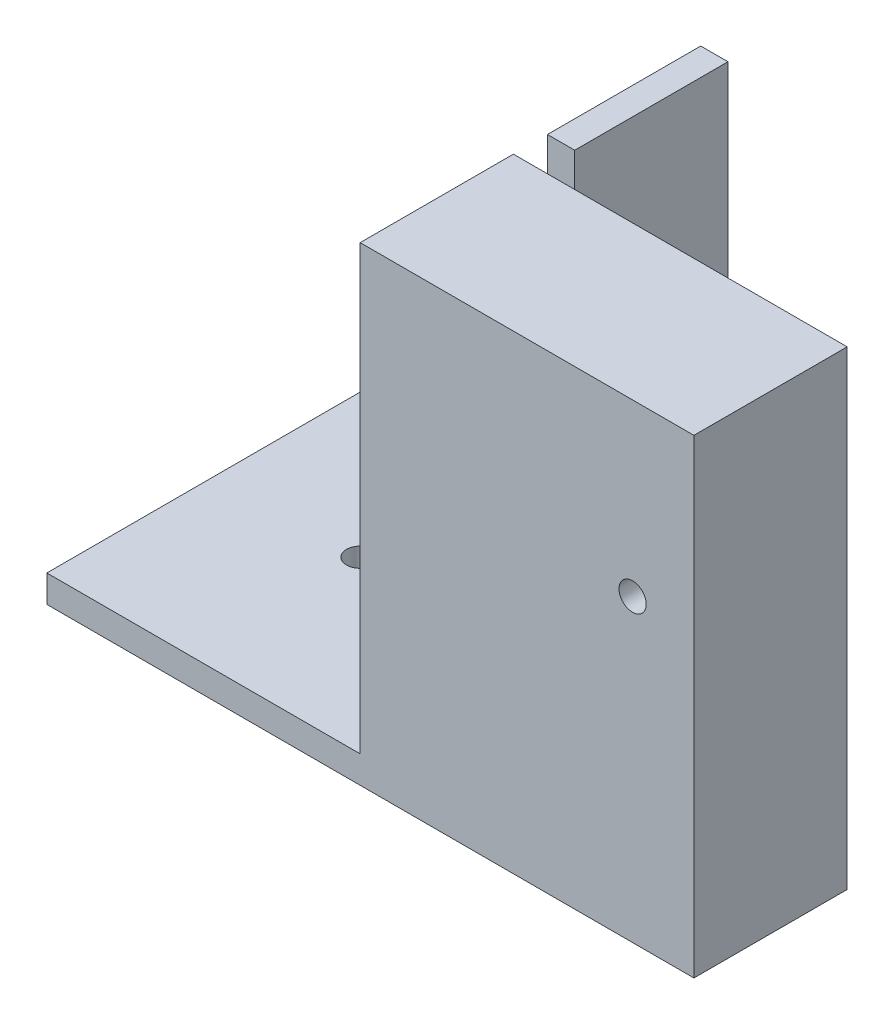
from build123d import *

# Parameters (mm, degrees)
AUFSATZ_LINEAR_AUSTRAGEN1_DEPTH      = 50
AUFSATZ_LINEAR_AUSTRAGEN1_DEPTH_BACK = 50
SKIZZE1_W                            = 100
SKIZZE1_H                            = 8
SKIZZE2_W                            = 8
SKIZZE2_H                            = 100
AUFSATZ_LINEAR_AUSTRAGEN2_DEPTH      = 130
SKIZZE3_W                            = 8
SKIZZE3_H                            = 10
SCHNITT_LINEAR_AUSTRAGEN1_DEPTH      = 130
SKIZZE4_W                            = 45
SKIZZE4_H                            = 138
AUFSATZ_LINEAR_AUSTRAGEN3_DEPTH      = 90
SKIZZE5_R                            = 4
SCHNITT_LINEAR_AUSTRAGEN2_DEPTH      = 50
SKIZZE6_R                            = 4
SCHNITT_LINEAR_AUSTRAGEN3_DEPTH      = 50


with BuildPart() as part:
    # Skizze1 → Aufsatz-Linear austragen1 (new, two sides: drawn at the far end of the back side and taken through both)
    with BuildSketch(Plane.XY.offset(-AUFSATZ_LINEAR_AUSTRAGEN1_DEPTH_BACK)):
        with Locations((-28.811994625, 2.30495957)):
            Rectangle(SKIZZE1_W, SKIZZE1_H)
    extrude(amount=AUFSATZ_LINEAR_AUSTRAGEN1_DEPTH + AUFSATZ_LINEAR_AUSTRAGEN1_DEPTH_BACK)

    # Skizze2 → Aufsatz-Linear austragen2 (add)
    with BuildSketch(Plane(origin=(0, 6.30495957, 0), x_dir=(1, 0, 0), z_dir=(0, 1, 0))):
        with Locations((17.188005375, 0)):
            Rectangle(SKIZZE2_W, SKIZZE2_H)
    extrude(amount=AUFSATZ_LINEAR_AUSTRAGEN2_DEPTH)

    # Skizze3 → Schnitt-Linear austragen1 (cut)
    with BuildSketch(Plane(origin=(0, 136.30495957, 0), x_dir=(1, 0, 0), z_dir=(0, 1, 0))):
        with Locations((17.188005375, 0)):
            Rectangle(SKIZZE3_W, SKIZZE3_H)
    extrude(amount=-SCHNITT_LINEAR_AUSTRAGEN1_DEPTH, mode=Mode.SUBTRACT)

    # Skizze4 → Aufsatz-Linear austragen3 (add)
    with BuildSketch(Plane(origin=(21.188005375, 0, 0), x_dir=(0, 0, -1), z_dir=(1, 0, 0))):
        with Locations((-27.5, 67.30495957)):
            Rectangle(SKIZZE4_W, SKIZZE4_H)
    extrude(amount=AUFSATZ_LINEAR_AUSTRAGEN3_DEPTH)

    # Skizze5 → Schnitt-Linear austragen2 (cut)
    with BuildSketch(Plane(origin=(0, 6.30495957, 0), x_dir=(1, 0, 0), z_dir=(0, 1, 0))):
        with Locations(Location((-36.811994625, 0, 0), (0, 0, 270))):
            Circle(SKIZZE5_R)
    extrude(amount=-SCHNITT_LINEAR_AUSTRAGEN2_DEPTH, mode=Mode.SUBTRACT)

    # Skizze6 → Schnitt-Linear austragen3 (cut)
    with BuildSketch(Plane.XY.offset(50)):
        with Locations((93.188005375, 86.30495957)):
            Circle(SKIZZE6_R)
    extrude(amount=-SCHNITT_LINEAR_AUSTRAGEN3_DEPTH, mode=Mode.SUBTRACT)


solid = part.part
